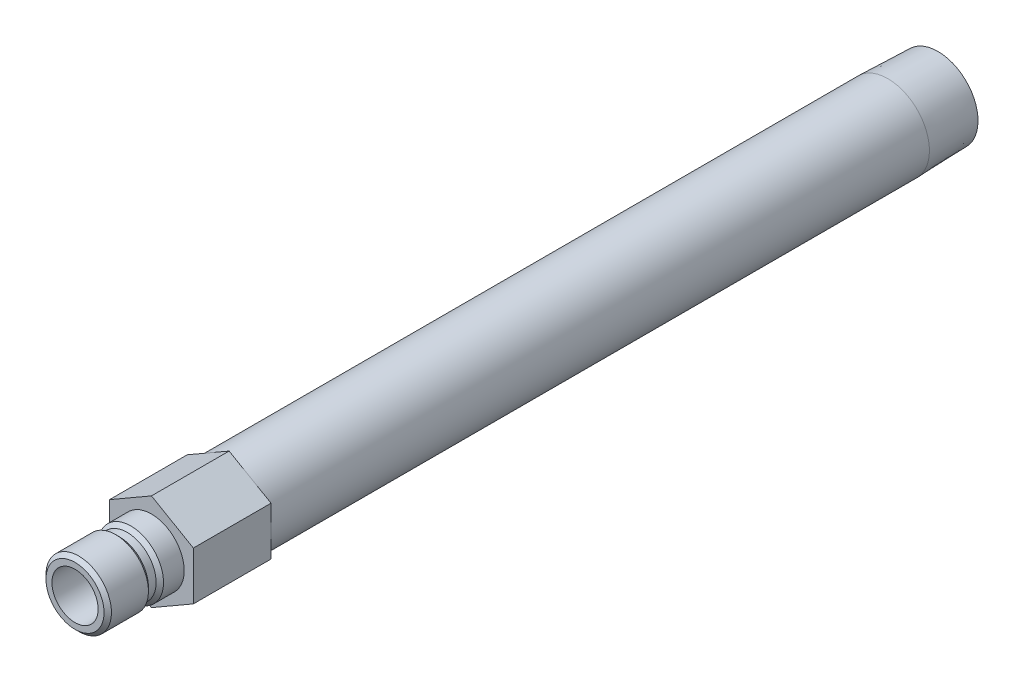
from build123d import *

# Parameters (mm, degrees)
SKETCH2_R           = 4.7625
BOSS_EXTRUDE1_DEPTH = 16.002


with BuildPart() as part:
    # Sketch1 → Revolve1 (revolve)
    with BuildSketch(Plane(origin=(0, 0, 0), x_dir=(0, 0, -1), z_dir=(1, 0, 0))):
        Polygon((-15.748, 4.7625), (-15.748, 5.9817), (-14.986, 6.7437), (-7.366, 6.7437), (-6.604, 5.9817), (-5.0165, 5.9817), (-4.2545, 6.7437), (0, 6.7437), (0, 8.5725), (151.7142, 8.5725), (162.052, 8.249445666), (162.052, 6.2611), (16.002, 6.2611), (16.002, 4.7625), align=None)
    revolve(axis=Axis((0, 0, 0), (0, 0, 1)))

    # Sketch2 → Boss-Extrude1 (add)
    with BuildSketch(Plane.XY):
        Polygon((-8.636, 4.985996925), (-8.636, -4.985996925), (0, -9.971993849), (8.636, -4.985996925), (8.636, 4.985996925), (0, 9.971993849), align=None)
        with Locations(Location((0, 0, 0), (0, 0, 90))):
            Circle(SKETCH2_R, mode=Mode.SUBTRACT)
    extrude(amount=-BOSS_EXTRUDE1_DEPTH)


solid = part.part
